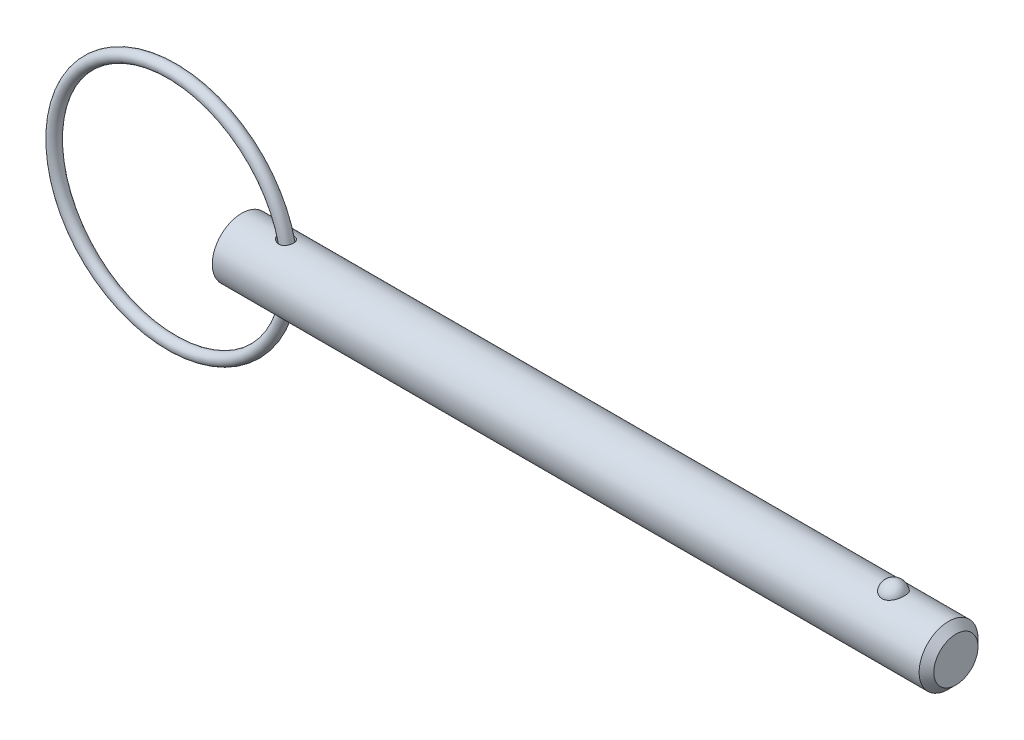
ISO-10303-21;
HEADER;
FILE_DESCRIPTION(('STEP AP214'),'2;1');
FILE_NAME('part.step','',(''),(''),'','','');
FILE_SCHEMA(('AUTOMOTIVE_DESIGN { 1 0 10303 214 1 1 1 1 }'));
ENDSEC;
DATA;
#1=APPLICATION_CONTEXT('core data for automotive mechanical design processes');
#2=APPLICATION_PROTOCOL_DEFINITION('international standard','automotive_design',2000,#1);
#3=PRODUCT_CONTEXT('',#1,'mechanical');
#4=PRODUCT('Part','Part','',(#3));
#5=PRODUCT_RELATED_PRODUCT_CATEGORY('part','',(#4));
#6=PRODUCT_DEFINITION_FORMATION('','',#4);
#7=PRODUCT_DEFINITION_CONTEXT('part definition',#1,'design');
#8=PRODUCT_DEFINITION('design','',#6,#7);
#9=PRODUCT_DEFINITION_SHAPE('','',#8);
#10=(LENGTH_UNIT() NAMED_UNIT(*) SI_UNIT(.MILLI.,.METRE.));
#11=(NAMED_UNIT(*) PLANE_ANGLE_UNIT() SI_UNIT($,.RADIAN.));
#12=(NAMED_UNIT(*) SI_UNIT($,.STERADIAN.) SOLID_ANGLE_UNIT());
#13=UNCERTAINTY_MEASURE_WITH_UNIT(LENGTH_MEASURE(1.E-05),#10,'distance_accuracy_value','');
#14=(GEOMETRIC_REPRESENTATION_CONTEXT(3) GLOBAL_UNCERTAINTY_ASSIGNED_CONTEXT((#13)) GLOBAL_UNIT_ASSIGNED_CONTEXT((#10,
#11,#12)) REPRESENTATION_CONTEXT('',''));
#15=CARTESIAN_POINT('',(0.,0.,0.));
#16=DIRECTION('',(0.,0.,1.));
#17=DIRECTION('',(1.,0.,0.));
#18=AXIS2_PLACEMENT_3D('',#15,#16,#17);
#19=CARTESIAN_POINT('',(-7.52490236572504,0.,0.));
#20=DIRECTION('',(0.,0.,1.));
#21=DIRECTION('',(1.,0.,0.));
#22=AXIS2_PLACEMENT_3D('',#19,#20,#21);
#23=TOROIDAL_SURFACE('',#22,12.7,0.635000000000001);
#24=CARTESIAN_POINT('',(5.81009763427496,0.,0.));
#25=VERTEX_POINT('',#24);
#26=VERTEX_LOOP('',#25);
#27=FACE_BOUND('',#26,.T.);
#28=ADVANCED_FACE('P0_F12',(#27),#23,.T.);
#29=CLOSED_SHELL('',(#28));
#30=MANIFOLD_SOLID_BREP('P0_B1',#29);
#31=CARTESIAN_POINT('',(0.,0.,0.));
#32=DIRECTION('',(1.,0.,0.));
#33=DIRECTION('',(0.,0.,-1.));
#34=AXIS2_PLACEMENT_3D('',#31,#32,#33);
#35=CYLINDRICAL_SURFACE('',#34,3.175);
#36=CARTESIAN_POINT('',(4.01221718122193,3.16142308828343,-0.293307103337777));
#37=CARTESIAN_POINT('',(4.03067993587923,3.15750982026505,-0.335477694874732));
#38=CARTESIAN_POINT('',(4.05297703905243,3.15289835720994,-0.375943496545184));
#39=CARTESIAN_POINT('',(4.10415276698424,3.14284099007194,-0.452407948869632));
#40=CARTESIAN_POINT('',(4.1330447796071,3.13739339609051,-0.488397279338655));
#41=CARTESIAN_POINT('',(4.19615348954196,3.12629932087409,-0.554988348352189));
#42=CARTESIAN_POINT('',(4.23034557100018,3.12065384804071,-0.585613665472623));
#43=CARTESIAN_POINT('',(4.3031328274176,3.10972452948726,-0.641123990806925));
#44=CARTESIAN_POINT('',(4.34172706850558,3.10444060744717,-0.666010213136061));
#45=CARTESIAN_POINT('',(4.42517725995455,3.09444053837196,-0.711079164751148));
#46=CARTESIAN_POINT('',(4.47028158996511,3.08978882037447,-0.730818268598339));
#47=CARTESIAN_POINT('',(4.56327045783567,3.08209858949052,-0.762602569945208));
#48=CARTESIAN_POINT('',(4.61115533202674,3.07906027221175,-0.774646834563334));
#49=CARTESIAN_POINT('',(4.70827322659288,3.0750396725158,-0.790458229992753));
#50=CARTESIAN_POINT('',(4.75750323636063,3.07405312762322,-0.79424252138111));
#51=CARTESIAN_POINT('',(4.85586074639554,3.07433427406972,-0.793155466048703));
#52=CARTESIAN_POINT('',(4.90498828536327,3.07560084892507,-0.788288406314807));
#53=CARTESIAN_POINT('',(4.99830385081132,3.08013122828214,-0.770385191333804));
#54=CARTESIAN_POINT('',(5.04260499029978,3.08325928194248,-0.757902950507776));
#55=CARTESIAN_POINT('',(5.1282462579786,3.09104671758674,-0.725486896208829));
#56=CARTESIAN_POINT('',(5.16958706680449,3.09570574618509,-0.705554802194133));
#57=CARTESIAN_POINT('',(5.24627719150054,3.10576748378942,-0.65981371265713));
#58=CARTESIAN_POINT('',(5.28181038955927,3.11112830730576,-0.634302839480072));
#59=CARTESIAN_POINT('',(5.34802604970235,3.12213947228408,-0.57766778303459));
#60=CARTESIAN_POINT('',(5.37870854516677,3.1277898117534,-0.546543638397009));
#61=CARTESIAN_POINT('',(5.43445707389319,3.13876145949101,-0.479533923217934));
#62=CARTESIAN_POINT('',(5.45951927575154,3.14408254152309,-0.443645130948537));
#63=CARTESIAN_POINT('',(5.50339935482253,3.15381660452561,-0.368122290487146));
#64=CARTESIAN_POINT('',(5.52221691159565,3.15822953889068,-0.328488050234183));
#65=CARTESIAN_POINT('',(5.55335622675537,3.16572312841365,-0.246075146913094));
#66=CARTESIAN_POINT('',(5.56559711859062,3.16878711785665,-0.203264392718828));
#67=CARTESIAN_POINT('',(5.58294807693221,3.17317503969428,-0.116135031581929));
#68=CARTESIAN_POINT('',(5.58805800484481,3.17449893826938,-0.0718163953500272));
#69=CARTESIAN_POINT('',(5.59103306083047,3.17526647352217,0.01723401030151));
#70=CARTESIAN_POINT('',(5.58887304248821,3.17470358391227,0.0619666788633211));
#71=CARTESIAN_POINT('',(5.57730300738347,3.17174350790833,0.15042284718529));
#72=CARTESIAN_POINT('',(5.56789286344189,3.16934628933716,0.1941463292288));
#73=CARTESIAN_POINT('',(5.54204285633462,3.16297605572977,0.27934466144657));
#74=CARTESIAN_POINT('',(5.52560272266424,3.15900298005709,0.320819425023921));
#75=CARTESIAN_POINT('',(5.4860820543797,3.14991364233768,0.400340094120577));
#76=CARTESIAN_POINT('',(5.46300145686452,3.14479736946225,0.438385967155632));
#77=CARTESIAN_POINT('',(5.41080575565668,3.1339965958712,0.509900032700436));
#78=CARTESIAN_POINT('',(5.3817004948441,3.12831302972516,0.54337554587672));
#79=CARTESIAN_POINT('',(5.31818122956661,3.11701107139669,0.604852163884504));
#80=CARTESIAN_POINT('',(5.2837678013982,3.11139267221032,0.632853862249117));
#81=CARTESIAN_POINT('',(5.21096127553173,3.10091904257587,0.682320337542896));
#82=CARTESIAN_POINT('',(5.1726139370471,3.09605639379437,0.703850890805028));
#83=CARTESIAN_POINT('',(5.09274050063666,3.08756769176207,0.740203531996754));
#84=CARTESIAN_POINT('',(5.05121474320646,3.08394150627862,0.755026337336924));
#85=CARTESIAN_POINT('',(4.96650658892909,3.07833156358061,0.777582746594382));
#86=CARTESIAN_POINT('',(4.92333841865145,3.07633606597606,0.785367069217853));
#87=CARTESIAN_POINT('',(4.83627503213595,3.07411756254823,0.794006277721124));
#88=CARTESIAN_POINT('',(4.79237971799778,3.07389479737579,0.794860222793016));
#89=CARTESIAN_POINT('',(4.70375644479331,3.0752087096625,0.789761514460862));
#90=CARTESIAN_POINT('',(4.65904075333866,3.07679607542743,0.783612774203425));
#91=CARTESIAN_POINT('',(4.57116325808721,3.08158486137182,0.764561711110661));
#92=CARTESIAN_POINT('',(4.52800197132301,3.08478681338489,0.751657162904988));
#93=CARTESIAN_POINT('',(4.44149370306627,3.09268658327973,0.718486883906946));
#94=CARTESIAN_POINT('',(4.39831651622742,3.0974680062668,0.697797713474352));
#95=CARTESIAN_POINT('',(4.31591226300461,3.10789270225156,0.649792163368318));
#96=CARTESIAN_POINT('',(4.27668695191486,3.11353635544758,0.622472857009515));
#97=CARTESIAN_POINT('',(4.20182407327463,3.1252888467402,0.560557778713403));
#98=CARTESIAN_POINT('',(4.16638921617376,3.13140725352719,0.525717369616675));
#99=CARTESIAN_POINT('',(4.10227951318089,3.14315144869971,0.450199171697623));
#100=CARTESIAN_POINT('',(4.0736023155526,3.14877740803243,0.409523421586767));
#101=CARTESIAN_POINT('',(4.02575866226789,3.15851130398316,0.325741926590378));
#102=CARTESIAN_POINT('',(4.00615248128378,3.16268619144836,0.282896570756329));
#103=CARTESIAN_POINT('',(3.97532986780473,3.16936826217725,0.1941636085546));
#104=CARTESIAN_POINT('',(3.96410589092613,3.17187694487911,0.148278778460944));
#105=CARTESIAN_POINT('',(3.95155037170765,3.17469339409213,0.0604600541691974));
#106=CARTESIAN_POINT('',(3.9492378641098,3.17521926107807,0.0186712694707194));
#107=CARTESIAN_POINT('',(3.95191506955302,3.1746144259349,-0.0646295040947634));
#108=CARTESIAN_POINT('',(3.9568961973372,3.17348567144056,-0.106141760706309));
#109=CARTESIAN_POINT('',(3.97060099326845,3.17043701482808,-0.172031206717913));
#110=CARTESIAN_POINT('',(3.97717137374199,3.16898333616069,-0.196902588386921));
#111=CARTESIAN_POINT('',(3.99283717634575,3.16556630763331,-0.245794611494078));
#112=CARTESIAN_POINT('',(4.00193224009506,3.16360303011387,-0.269815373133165));
#113=CARTESIAN_POINT('',(4.01221718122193,3.16142308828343,-0.293307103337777));
#114=B_SPLINE_CURVE_WITH_KNOTS('',3,(#36,#37,#38,#39,#40,#41,#42,#43,#44,#45,#46,#47,#48,#49,
#50,#51,#52,#53,#54,#55,#56,#57,#58,#59,#60,#61,#62,#63,#64,#65,#66,#67,#68,#69,#70,#71,#72,#73,
#74,#75,#76,#77,#78,#79,#80,#81,#82,#83,#84,#85,#86,#87,#88,#89,#90,#91,#92,#93,#94,#95,#96,#97,
#98,#99,#100,#101,#102,#103,#104,#105,#106,#107,#108,#109,#110,#111,#112,#113),.UNSPECIFIED.,
.T.,.F.,(4,2,2,2,2,2,2,2,2,2,2,2,2,2,2,2,2,2,2,2,2,2,2,2,2,2,2,2,2,2,2,2,2,2,2,2,2,2,4),(0.,
0.138498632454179,0.277280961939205,0.41543703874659,0.553563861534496,0.701231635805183,
0.848917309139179,0.996295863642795,1.14360140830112,1.28129260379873,1.41895203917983,
1.55053732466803,1.68212170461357,1.81379551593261,1.94547608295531,2.07874074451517,
2.21200799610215,2.34573668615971,2.47946772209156,2.61320390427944,2.74694135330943,
2.8804620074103,3.01396817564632,3.14606745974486,3.27815261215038,3.40927820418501,
3.54042159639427,3.6753294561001,3.81028178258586,3.95399377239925,4.09776931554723,
4.24721954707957,4.39661769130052,4.53771923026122,4.67869361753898,4.80361432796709,
4.92838811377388,5.00555170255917,5.08270434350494),.UNSPECIFIED.);
#115=CARTESIAN_POINT('',(4.01221718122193,3.16142308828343,-0.293307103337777));
#116=VERTEX_POINT('',#115);
#117=EDGE_CURVE('P1_E40',#116,#116,#114,.T.);
#118=ORIENTED_EDGE('',*,*,#117,.T.);
#119=EDGE_LOOP('',(#118));
#120=FACE_BOUND('',#119,.T.);
#121=CARTESIAN_POINT('',(76.21625,0.,0.));
#122=DIRECTION('',(1.,0.,0.));
#123=DIRECTION('',(0.,0.,-1.));
#124=AXIS2_PLACEMENT_3D('',#121,#122,#123);
#125=CIRCLE('',#124,3.175);
#126=CARTESIAN_POINT('',(76.21625,0.,-3.175));
#127=VERTEX_POINT('',#126);
#128=EDGE_CURVE('P1_E25',#127,#127,#125,.T.);
#129=ORIENTED_EDGE('',*,*,#128,.F.);
#130=EDGE_LOOP('',(#129));
#131=FACE_BOUND('',#130,.T.);
#132=CARTESIAN_POINT('',(0.,0.,0.));
#133=DIRECTION('',(1.,0.,0.));
#134=DIRECTION('',(0.,0.,-1.));
#135=AXIS2_PLACEMENT_3D('',#132,#133,#134);
#136=CIRCLE('',#135,3.175);
#137=CARTESIAN_POINT('',(0.,0.,-3.175));
#138=VERTEX_POINT('',#137);
#139=EDGE_CURVE('P1_E9',#138,#138,#136,.T.);
#140=ORIENTED_EDGE('',*,*,#139,.T.);
#141=EDGE_LOOP('',(#140));
#142=FACE_BOUND('',#141,.T.);
#143=CARTESIAN_POINT('',(70.2757276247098,2.92898950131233,1.2254164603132));
#144=CARTESIAN_POINT('',(70.212316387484,2.92899434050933,1.22541146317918));
#145=CARTESIAN_POINT('',(70.1487979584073,2.93112688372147,1.2203464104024));
#146=CARTESIAN_POINT('',(70.0235306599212,2.93942752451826,1.20020949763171));
#147=CARTESIAN_POINT('',(69.9617869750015,2.9456063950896,1.1851109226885));
#148=CARTESIAN_POINT('',(69.8420651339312,2.96127115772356,1.14540352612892));
#149=CARTESIAN_POINT('',(69.7840775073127,2.97074831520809,1.12081980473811));
#150=CARTESIAN_POINT('',(69.6731943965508,2.99197584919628,1.06285154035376));
#151=CARTESIAN_POINT('',(69.6202966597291,3.0037252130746,1.02947091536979));
#152=CARTESIAN_POINT('',(69.5192688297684,3.02865714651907,0.953674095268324));
#153=CARTESIAN_POINT('',(69.471324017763,3.04187163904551,0.911021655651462));
#154=CARTESIAN_POINT('',(69.3830360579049,3.06808741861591,0.818400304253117));
#155=CARTESIAN_POINT('',(69.3426952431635,3.08108863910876,0.768429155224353));
#156=CARTESIAN_POINT('',(69.2688039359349,3.10614903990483,0.660064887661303));
#157=CARTESIAN_POINT('',(69.2356330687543,3.11814104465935,0.601396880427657));
#158=CARTESIAN_POINT('',(69.1791190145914,3.13926931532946,0.47902691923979));
#159=CARTESIAN_POINT('',(69.1557764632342,3.14840539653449,0.415324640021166));
#160=CARTESIAN_POINT('',(69.1191785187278,3.16298160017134,0.283885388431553));
#161=CARTESIAN_POINT('',(69.1060407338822,3.16837855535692,0.216110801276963));
#162=CARTESIAN_POINT('',(69.0905676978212,3.17475386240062,0.0791367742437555));
#163=CARTESIAN_POINT('',(69.088232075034,3.17573236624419,0.0099373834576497));
#164=CARTESIAN_POINT('',(69.094388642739,3.17318075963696,-0.127420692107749));
#165=CARTESIAN_POINT('',(69.1028073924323,3.16968122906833,-0.195583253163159));
#166=CARTESIAN_POINT('',(69.1301752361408,3.1585790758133,-0.329413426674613));
#167=CARTESIAN_POINT('',(69.1491245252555,3.15097637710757,-0.395080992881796));
#168=CARTESIAN_POINT('',(69.1972057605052,3.13242485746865,-0.5221806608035));
#169=CARTESIAN_POINT('',(69.2263524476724,3.12147119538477,-0.583606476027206));
#170=CARTESIAN_POINT('',(69.2942352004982,3.09734973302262,-0.700436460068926));
#171=CARTESIAN_POINT('',(69.332972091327,3.08418174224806,-0.755840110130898));
#172=CARTESIAN_POINT('',(69.4194771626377,3.05694884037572,-0.85940454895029));
#173=CARTESIAN_POINT('',(69.4672961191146,3.04287919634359,-0.907521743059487));
#174=CARTESIAN_POINT('',(69.5707353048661,3.01548927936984,-0.99475883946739));
#175=CARTESIAN_POINT('',(69.6263549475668,3.0021689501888,-1.03387941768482));
#176=CARTESIAN_POINT('',(69.7428093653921,2.97810316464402,-1.10126594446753));
#177=CARTESIAN_POINT('',(69.8035182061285,2.96731170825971,-1.12973256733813));
#178=CARTESIAN_POINT('',(69.9293712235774,2.94928934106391,-1.17598467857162));
#179=CARTESIAN_POINT('',(69.9945137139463,2.94205708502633,-1.19377420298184));
#180=CARTESIAN_POINT('',(70.1238562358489,2.93233065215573,-1.21746387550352));
#181=CARTESIAN_POINT('',(70.1879385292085,2.92961621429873,-1.22391763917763));
#182=CARTESIAN_POINT('',(70.3163375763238,2.92855752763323,-1.22644976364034));
#183=CARTESIAN_POINT('',(70.3806542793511,2.93021238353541,-1.22253024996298));
#184=CARTESIAN_POINT('',(70.5055239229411,2.9375685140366,-1.20474140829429));
#185=CARTESIAN_POINT('',(70.566131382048,2.94313790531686,-1.19119621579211));
#186=CARTESIAN_POINT('',(70.6841106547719,2.95756226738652,-1.15491492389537));
#187=CARTESIAN_POINT('',(70.7414822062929,2.96641750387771,-1.13217808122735));
#188=CARTESIAN_POINT('',(70.8527699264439,2.98669918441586,-1.07755083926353));
#189=CARTESIAN_POINT('',(70.9065845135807,2.9981771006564,-1.0454730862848));
#190=CARTESIAN_POINT('',(71.0081473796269,3.02240235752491,-0.973220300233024));
#191=CARTESIAN_POINT('',(71.0558942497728,3.03514999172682,-0.933043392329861));
#192=CARTESIAN_POINT('',(71.1465817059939,3.06131230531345,-0.843372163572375));
#193=CARTESIAN_POINT('',(71.1891588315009,3.07472822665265,-0.79351033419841));
#194=CARTESIAN_POINT('',(71.2656765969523,3.10021106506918,-0.687241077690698));
#195=CARTESIAN_POINT('',(71.2996156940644,3.1122777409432,-0.630832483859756));
#196=CARTESIAN_POINT('',(71.3591209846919,3.134208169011,-0.511059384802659));
#197=CARTESIAN_POINT('',(71.3843892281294,3.14399040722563,-0.447531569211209));
#198=CARTESIAN_POINT('',(71.4245117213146,3.15983820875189,-0.316827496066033));
#199=CARTESIAN_POINT('',(71.4393659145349,3.16590375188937,-0.249651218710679));
#200=CARTESIAN_POINT('',(71.458358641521,3.17370076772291,-0.113549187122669));
#201=CARTESIAN_POINT('',(71.4624966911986,3.17543204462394,-0.0446233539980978));
#202=CARTESIAN_POINT('',(71.4599697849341,3.17438372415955,0.0929938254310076));
#203=CARTESIAN_POINT('',(71.4533050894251,3.17160423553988,0.161685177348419));
#204=CARTESIAN_POINT('',(71.4293754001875,3.1618438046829,0.296502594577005));
#205=CARTESIAN_POINT('',(71.4121674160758,3.15488546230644,0.36264043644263));
#206=CARTESIAN_POINT('',(71.367547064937,3.13748892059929,0.490896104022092));
#207=CARTESIAN_POINT('',(71.3401339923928,3.12705048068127,0.553013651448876));
#208=CARTESIAN_POINT('',(71.2754626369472,3.10369139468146,0.671876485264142));
#209=CARTESIAN_POINT('',(71.2381467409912,3.0907563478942,0.728587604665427));
#210=CARTESIAN_POINT('',(71.1545246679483,3.06381731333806,0.834653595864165));
#211=CARTESIAN_POINT('',(71.1082189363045,3.04981337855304,0.884008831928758));
#212=CARTESIAN_POINT('',(71.0077184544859,3.02230423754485,0.97391679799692));
#213=CARTESIAN_POINT('',(70.953535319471,3.00879833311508,1.01448227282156));
#214=CARTESIAN_POINT('',(70.8385299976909,2.98383625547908,1.0857155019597));
#215=CARTESIAN_POINT('',(70.7777053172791,2.9723808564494,1.11637952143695));
#216=CARTESIAN_POINT('',(70.6533690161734,2.95329063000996,1.16592590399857));
#217=CARTESIAN_POINT('',(70.5900230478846,2.9455373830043,1.18517901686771));
#218=CARTESIAN_POINT('',(70.4607664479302,2.9342556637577,1.21284802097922));
#219=CARTESIAN_POINT('',(70.3948641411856,2.93071450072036,1.2212964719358));
#220=CARTESIAN_POINT('',(70.311116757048,2.9291525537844,1.22502505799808));
#221=CARTESIAN_POINT('',(70.2934263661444,2.92898815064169,1.22541785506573));
#222=CARTESIAN_POINT('',(70.2757276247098,2.92898950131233,1.2254164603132));
#223=B_SPLINE_CURVE_WITH_KNOTS('',3,(#143,#144,#145,#146,#147,#148,#149,#150,#151,#152,#153,
#154,#155,#156,#157,#158,#159,#160,#161,#162,#163,#164,#165,#166,#167,#168,#169,#170,#171,#172,
#173,#174,#175,#176,#177,#178,#179,#180,#181,#182,#183,#184,#185,#186,#187,#188,#189,#190,#191,
#192,#193,#194,#195,#196,#197,#198,#199,#200,#201,#202,#203,#204,#205,#206,#207,#208,#209,#210,
#211,#212,#213,#214,#215,#216,#217,#218,#219,#220,#221,#222),.UNSPECIFIED.,.T.,.F.,(4,2,2,2,2,2,
2,2,2,2,2,2,2,2,2,2,2,2,2,2,2,2,2,2,2,2,2,2,2,2,2,2,2,2,2,2,2,2,2,4),(0.,0.190186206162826,
0.380880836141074,0.571074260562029,0.761183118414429,0.956866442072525,1.15260970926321,
1.35701770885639,1.56143892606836,1.76818248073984,1.97491892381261,2.18025109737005,
2.38558707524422,2.59122111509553,2.79687285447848,3.00371012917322,3.21053185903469,
3.41323429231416,3.61586005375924,3.80828192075,4.00066436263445,4.18685798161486,
4.37306665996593,4.56330302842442,4.75358348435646,4.95345287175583,5.15335793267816,
5.35957003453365,5.56578325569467,5.7720057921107,5.97822335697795,6.18333558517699,
6.38846199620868,6.59480900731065,6.80114579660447,7.00718137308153,7.21329457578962,
7.41228022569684,7.61066481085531,7.66374777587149),.UNSPECIFIED.);
#224=CARTESIAN_POINT('',(70.2757276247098,2.92898950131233,1.2254164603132));
#225=VERTEX_POINT('',#224);
#226=EDGE_CURVE('P1_E34',#225,#225,#223,.T.);
#227=ORIENTED_EDGE('',*,*,#226,.T.);
#228=EDGE_LOOP('',(#227));
#229=FACE_BOUND('',#228,.T.);
#230=CARTESIAN_POINT('',(4.01221718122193,-3.16142308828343,-0.293307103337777));
#231=CARTESIAN_POINT('',(3.99616924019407,-3.16482429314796,-0.256648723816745));
#232=CARTESIAN_POINT('',(3.9830087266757,-3.16769953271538,-0.218679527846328));
#233=CARTESIAN_POINT('',(3.96305928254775,-3.17210414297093,-0.141027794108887));
#234=CARTESIAN_POINT('',(3.95626715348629,-3.17363418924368,-0.101346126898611));
#235=CARTESIAN_POINT('',(3.94940055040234,-3.17518116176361,-0.0213063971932));
#236=CARTESIAN_POINT('',(3.94933713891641,-3.17519559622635,0.0190526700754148));
#237=CARTESIAN_POINT('',(3.95595884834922,-3.173703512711,0.0991848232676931));
#238=CARTESIAN_POINT('',(3.96264478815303,-3.17219681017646,0.138957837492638));
#239=CARTESIAN_POINT('',(3.98225001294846,-3.16786598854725,0.216153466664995));
#240=CARTESIAN_POINT('',(3.99506606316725,-3.16506371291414,0.253603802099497));
#241=CARTESIAN_POINT('',(4.0263107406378,-3.15843101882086,0.325977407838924));
#242=CARTESIAN_POINT('',(4.04474073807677,-3.15460034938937,0.360900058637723));
#243=CARTESIAN_POINT('',(4.0879644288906,-3.14597426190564,0.429836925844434));
#244=CARTESIAN_POINT('',(4.1131071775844,-3.1411307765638,0.463625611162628));
#245=CARTESIAN_POINT('',(4.16818460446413,-3.13112506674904,0.526983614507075));
#246=CARTESIAN_POINT('',(4.1981214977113,-3.1259626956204,0.556550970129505));
#247=CARTESIAN_POINT('',(4.26550089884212,-3.11521604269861,0.614003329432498));
#248=CARTESIAN_POINT('',(4.3034063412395,-3.10964747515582,0.641349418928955));
#249=CARTESIAN_POINT('',(4.38313680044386,-3.09926692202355,0.68977116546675));
#250=CARTESIAN_POINT('',(4.42496355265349,-3.09445527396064,0.710844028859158));
#251=CARTESIAN_POINT('',(4.51417855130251,-3.08586578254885,0.747282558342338));
#252=CARTESIAN_POINT('',(4.56175044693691,-3.08216903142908,0.762221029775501));
#253=CARTESIAN_POINT('',(4.6588493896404,-3.076742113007,0.783842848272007));
#254=CARTESIAN_POINT('',(4.70837600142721,-3.07501151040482,0.790528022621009));
#255=CARTESIAN_POINT('',(4.80630979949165,-3.07383938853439,0.7950736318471));
#256=CARTESIAN_POINT('',(4.85470314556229,-3.07432752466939,0.793205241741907));
#257=CARTESIAN_POINT('',(4.95034305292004,-3.07744489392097,0.781023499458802));
#258=CARTESIAN_POINT('',(4.99759012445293,-3.0800731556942,0.770713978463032));
#259=CARTESIAN_POINT('',(5.08626194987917,-3.08693276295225,0.742738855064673));
#260=CARTESIAN_POINT('',(5.1278649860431,-3.09104603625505,0.725607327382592));
#261=CARTESIAN_POINT('',(5.20739903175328,-3.10040746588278,0.684500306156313));
#262=CARTESIAN_POINT('',(5.24533051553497,-3.10565547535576,0.660525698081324));
#263=CARTESIAN_POINT('',(5.31542898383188,-3.11652031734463,0.607160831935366));
#264=CARTESIAN_POINT('',(5.34772618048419,-3.12212297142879,0.577938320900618));
#265=CARTESIAN_POINT('',(5.40696901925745,-3.13320503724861,0.51447712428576));
#266=CARTESIAN_POINT('',(5.43391452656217,-3.13868444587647,0.48023831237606));
#267=CARTESIAN_POINT('',(5.4820017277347,-3.14897211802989,0.407384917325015));
#268=CARTESIAN_POINT('',(5.50309185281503,-3.15377424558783,0.368735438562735));
#269=CARTESIAN_POINT('',(5.53866240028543,-3.16213411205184,0.288380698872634));
#270=CARTESIAN_POINT('',(5.55314252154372,-3.16569179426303,0.246675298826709));
#271=CARTESIAN_POINT('',(5.57526489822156,-3.17121134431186,0.160950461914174));
#272=CARTESIAN_POINT('',(5.58283917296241,-3.17315732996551,0.116912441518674));
#273=CARTESIAN_POINT('',(5.59072863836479,-3.17518554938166,0.0281485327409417));
#274=CARTESIAN_POINT('',(5.59104374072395,-3.17526776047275,-0.016577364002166));
#275=CARTESIAN_POINT('',(5.58440302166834,-3.17355847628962,-0.105510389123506));
#276=CARTESIAN_POINT('',(5.57743745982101,-3.17176447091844,-0.149716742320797));
#277=CARTESIAN_POINT('',(5.55638330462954,-3.16649194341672,-0.23629572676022));
#278=CARTESIAN_POINT('',(5.54229454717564,-3.16301338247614,-0.278668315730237));
#279=CARTESIAN_POINT('',(5.50732506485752,-3.15474878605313,-0.360378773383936));
#280=CARTESIAN_POINT('',(5.48644386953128,-3.14996266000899,-0.399716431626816));
#281=CARTESIAN_POINT('',(5.43839310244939,-3.13960947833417,-0.47422997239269));
#282=CARTESIAN_POINT('',(5.41122365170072,-3.1340424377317,-0.509405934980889));
#283=CARTESIAN_POINT('',(5.35140258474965,-3.12277449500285,-0.574449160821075));
#284=CARTESIAN_POINT('',(5.31877354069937,-3.11707422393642,-0.604337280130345));
#285=CARTESIAN_POINT('',(5.24883067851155,-3.10616541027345,-0.658116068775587));
#286=CARTESIAN_POINT('',(5.21151752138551,-3.1009567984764,-0.682007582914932));
#287=CARTESIAN_POINT('',(5.13375489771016,-3.09168295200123,-0.722881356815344));
#288=CARTESIAN_POINT('',(5.09335030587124,-3.0876042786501,-0.739946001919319));
#289=CARTESIAN_POINT('',(5.0101742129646,-3.08094605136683,-0.767199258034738));
#290=CARTESIAN_POINT('',(4.96740279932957,-3.07836644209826,-0.777388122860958));
#291=CARTESIAN_POINT('',(4.88066362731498,-3.07495302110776,-0.790782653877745));
#292=CARTESIAN_POINT('',(4.8366943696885,-3.07412150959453,-0.793979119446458));
#293=CARTESIAN_POINT('',(4.74880185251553,-3.07424620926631,-0.793495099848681));
#294=CARTESIAN_POINT('',(4.70487860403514,-3.07520278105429,-0.789813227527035));
#295=CARTESIAN_POINT('',(4.61626456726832,-3.07882608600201,-0.775571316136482));
#296=CARTESIAN_POINT('',(4.571624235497,-3.08156578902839,-0.764717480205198));
#297=CARTESIAN_POINT('',(4.48464592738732,-3.08847909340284,-0.736297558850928));
#298=CARTESIAN_POINT('',(4.44230893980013,-3.09265330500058,-0.718728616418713));
#299=CARTESIAN_POINT('',(4.35823256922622,-3.10228551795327,-0.675988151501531));
#300=CARTESIAN_POINT('',(4.31671586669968,-3.10780992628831,-0.650392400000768));
#301=CARTESIAN_POINT('',(4.23853942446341,-3.11932897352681,-0.592684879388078));
#302=CARTESIAN_POINT('',(4.20188053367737,-3.12532369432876,-0.560571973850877));
#303=CARTESIAN_POINT('',(4.13583653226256,-3.13687565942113,-0.491740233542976));
#304=CARTESIAN_POINT('',(4.10623659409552,-3.14244088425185,-0.455229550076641));
#305=CARTESIAN_POINT('',(4.05384351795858,-3.1527191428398,-0.377513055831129));
#306=CARTESIAN_POINT('',(4.03104346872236,-3.1574330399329,-0.336312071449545));
#307=CARTESIAN_POINT('',(4.01221718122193,-3.16142308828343,-0.293307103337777));
#308=B_SPLINE_CURVE_WITH_KNOTS('',3,(#230,#231,#232,#233,#234,#235,#236,#237,#238,#239,#240,
#241,#242,#243,#244,#245,#246,#247,#248,#249,#250,#251,#252,#253,#254,#255,#256,#257,#258,#259,
#260,#261,#262,#263,#264,#265,#266,#267,#268,#269,#270,#271,#272,#273,#274,#275,#276,#277,#278,
#279,#280,#281,#282,#283,#284,#285,#286,#287,#288,#289,#290,#291,#292,#293,#294,#295,#296,#297,
#298,#299,#300,#301,#302,#303,#304,#305,#306,#307),.UNSPECIFIED.,.T.,.F.,(4,2,2,2,2,2,2,2,2,2,2,
2,2,2,2,2,2,2,2,2,2,2,2,2,2,2,2,2,2,2,2,2,2,2,2,2,2,2,4),(0.,0.120338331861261,
0.240616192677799,0.361091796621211,0.481582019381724,0.600110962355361,0.718668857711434,
0.845336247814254,0.972062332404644,1.1126676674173,1.25333552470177,1.40259505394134,
1.55182153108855,1.69635040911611,1.84081372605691,1.97568175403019,2.11053233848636,
2.24166080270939,2.37279256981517,2.50504501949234,2.63730349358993,2.77085027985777,
2.90439869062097,3.03812599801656,3.17185638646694,3.30559603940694,3.43933311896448,
3.57253035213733,3.70570880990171,3.83722775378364,3.96874184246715,4.10042887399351,
4.23214246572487,4.36961700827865,4.5071501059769,4.65373408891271,4.8003436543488,
4.94166003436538,5.08283228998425),.UNSPECIFIED.);
#309=CARTESIAN_POINT('',(4.01221718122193,-3.16142308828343,-0.293307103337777));
#310=VERTEX_POINT('',#309);
#311=EDGE_CURVE('P1_E17',#310,#310,#308,.T.);
#312=ORIENTED_EDGE('',*,*,#311,.T.);
#313=EDGE_LOOP('',(#312));
#314=FACE_BOUND('',#313,.T.);
#315=ADVANCED_FACE('P1_F13',(#120,#131,#142,#229,#314),#35,.T.);
#316=CARTESIAN_POINT('',(0.,0.,0.));
#317=DIRECTION('',(-1.,0.,0.));
#318=DIRECTION('',(0.,0.,1.));
#319=AXIS2_PLACEMENT_3D('',#316,#317,#318);
#320=PLANE('',#319);
#321=ORIENTED_EDGE('',*,*,#139,.F.);
#322=EDGE_LOOP('',(#321));
#323=FACE_BOUND('',#322,.T.);
#324=ADVANCED_FACE('P1_F15',(#323),#320,.T.);
#325=CARTESIAN_POINT('',(77.01,0.,0.));
#326=DIRECTION('',(-1.,0.,0.));
#327=DIRECTION('',(0.,0.,1.));
#328=AXIS2_PLACEMENT_3D('',#325,#326,#327);
#329=CONICAL_SURFACE('',#328,2.38125000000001,0.785398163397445);
#330=ORIENTED_EDGE('',*,*,#128,.T.);
#331=EDGE_LOOP('',(#330));
#332=FACE_BOUND('',#331,.T.);
#333=CARTESIAN_POINT('',(77.01,0.,0.));
#334=DIRECTION('',(1.,0.,0.));
#335=DIRECTION('',(0.,0.,-1.));
#336=AXIS2_PLACEMENT_3D('',#333,#334,#335);
#337=CIRCLE('',#336,2.38125000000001);
#338=CARTESIAN_POINT('',(77.01,0.,-2.38125000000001));
#339=VERTEX_POINT('',#338);
#340=EDGE_CURVE('P1_E30',#339,#339,#337,.T.);
#341=ORIENTED_EDGE('',*,*,#340,.F.);
#342=EDGE_LOOP('',(#341));
#343=FACE_BOUND('',#342,.T.);
#344=ADVANCED_FACE('P1_F55',(#332,#343),#329,.T.);
#345=CARTESIAN_POINT('',(77.01,2.38125000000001,0.));
#346=DIRECTION('',(1.,0.,0.));
#347=DIRECTION('',(0.,0.,-1.));
#348=AXIS2_PLACEMENT_3D('',#345,#346,#347);
#349=PLANE('',#348);
#350=ORIENTED_EDGE('',*,*,#340,.T.);
#351=EDGE_LOOP('',(#350));
#352=FACE_BOUND('',#351,.T.);
#353=ADVANCED_FACE('P1_F51',(#352),#349,.T.);
#354=CARTESIAN_POINT('',(70.2757276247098,2.8575,0.));
#355=DIRECTION('',(-1.,0.,0.));
#356=DIRECTION('',(0.,1.,0.));
#357=AXIS2_PLACEMENT_3D('',#354,#355,#356);
#358=SPHERICAL_SURFACE('',#357,1.22750000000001);
#359=ORIENTED_EDGE('',*,*,#226,.F.);
#360=EDGE_LOOP('',(#359));
#361=FACE_BOUND('',#360,.T.);
#362=ADVANCED_FACE('P1_F46',(#361),#358,.T.);
#363=CARTESIAN_POINT('',(-7.52490236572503,0.,0.));
#364=DIRECTION('',(0.,0.,1.));
#365=DIRECTION('',(1.,0.,0.));
#366=AXIS2_PLACEMENT_3D('',#363,#364,#365);
#367=TOROIDAL_SURFACE('',#366,12.7,0.79375);
#368=ORIENTED_EDGE('',*,*,#311,.F.);
#369=EDGE_LOOP('',(#368));
#370=FACE_BOUND('',#369,.T.);
#371=ORIENTED_EDGE('',*,*,#117,.F.);
#372=EDGE_LOOP('',(#371));
#373=FACE_BOUND('',#372,.T.);
#374=ADVANCED_FACE('P1_F50',(#370,#373),#367,.F.);
#375=CLOSED_SHELL('',(#315,#324,#344,#353,#362,#374));
#376=MANIFOLD_SOLID_BREP('P1_B1',#375);
#377=ADVANCED_BREP_SHAPE_REPRESENTATION('',(#18,#30,#376),#14);
#378=SHAPE_DEFINITION_REPRESENTATION(#9,#377);
ENDSEC;
END-ISO-10303-21;
